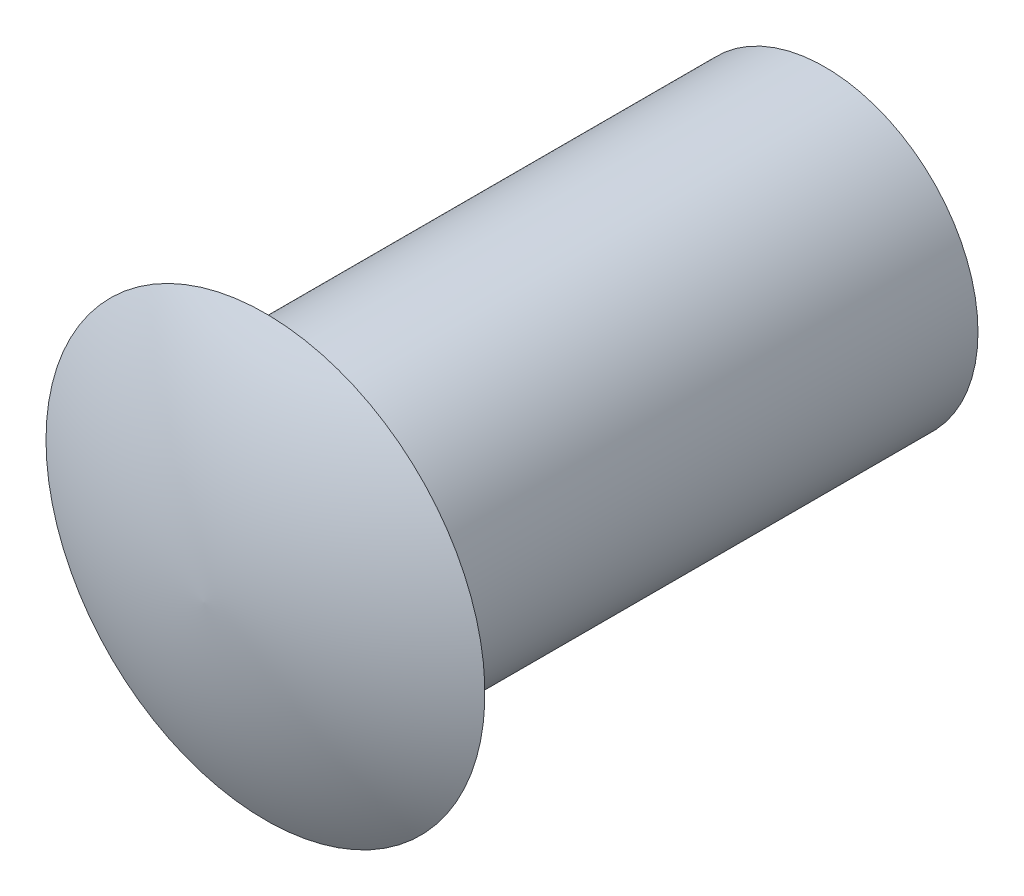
ISO-10303-21;
HEADER;
FILE_DESCRIPTION(('STEP AP214'),'2;1');
FILE_NAME('part.step','',(''),(''),'','','');
FILE_SCHEMA(('AUTOMOTIVE_DESIGN { 1 0 10303 214 1 1 1 1 }'));
ENDSEC;
DATA;
#1=APPLICATION_CONTEXT('core data for automotive mechanical design processes');
#2=APPLICATION_PROTOCOL_DEFINITION('international standard','automotive_design',2000,#1);
#3=PRODUCT_CONTEXT('',#1,'mechanical');
#4=PRODUCT('Part','Part','',(#3));
#5=PRODUCT_RELATED_PRODUCT_CATEGORY('part','',(#4));
#6=PRODUCT_DEFINITION_FORMATION('','',#4);
#7=PRODUCT_DEFINITION_CONTEXT('part definition',#1,'design');
#8=PRODUCT_DEFINITION('design','',#6,#7);
#9=PRODUCT_DEFINITION_SHAPE('','',#8);
#10=(LENGTH_UNIT() NAMED_UNIT(*) SI_UNIT(.MILLI.,.METRE.));
#11=(NAMED_UNIT(*) PLANE_ANGLE_UNIT() SI_UNIT($,.RADIAN.));
#12=(NAMED_UNIT(*) SI_UNIT($,.STERADIAN.) SOLID_ANGLE_UNIT());
#13=UNCERTAINTY_MEASURE_WITH_UNIT(LENGTH_MEASURE(1.E-05),#10,'distance_accuracy_value','');
#14=(GEOMETRIC_REPRESENTATION_CONTEXT(3) GLOBAL_UNCERTAINTY_ASSIGNED_CONTEXT((#13)) GLOBAL_UNIT_ASSIGNED_CONTEXT((#10,
#11,#12)) REPRESENTATION_CONTEXT('',''));
#15=CARTESIAN_POINT('',(0.,0.,0.));
#16=DIRECTION('',(0.,0.,1.));
#17=DIRECTION('',(1.,0.,0.));
#18=AXIS2_PLACEMENT_3D('',#15,#16,#17);
#19=CARTESIAN_POINT('',(0.,0.,-3.81));
#20=DIRECTION('',(0.,0.,1.));
#21=DIRECTION('',(1.,0.,0.));
#22=AXIS2_PLACEMENT_3D('',#19,#20,#21);
#23=CYLINDRICAL_SURFACE('',#22,1.04267733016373);
#24=CARTESIAN_POINT('',(0.,0.,-3.81));
#25=DIRECTION('',(0.,0.,1.));
#26=DIRECTION('',(1.,0.,0.));
#27=AXIS2_PLACEMENT_3D('',#24,#25,#26);
#28=CIRCLE('',#27,1.04267733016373);
#29=CARTESIAN_POINT('',(1.04267733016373,0.,-3.81));
#30=VERTEX_POINT('',#29);
#31=EDGE_CURVE('E11',#30,#30,#28,.T.);
#32=CARTESIAN_POINT('',(0.,0.,0.));
#33=DIRECTION('',(0.,0.,1.));
#34=DIRECTION('',(1.,0.,0.));
#35=AXIS2_PLACEMENT_3D('',#32,#33,#34);
#36=CIRCLE('',#35,1.04267733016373);
#37=CARTESIAN_POINT('',(1.04267733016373,0.,0.));
#38=VERTEX_POINT('',#37);
#39=EDGE_CURVE('E36',#38,#38,#36,.T.);
#40=CARTESIAN_POINT('',(1.04267733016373,0.,-3.81));
#41=CARTESIAN_POINT('',(1.04267733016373,0.,-3.7703125));
#42=CARTESIAN_POINT('',(1.04267733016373,0.,-3.730625));
#43=CARTESIAN_POINT('',(1.04267733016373,0.,-3.65125));
#44=CARTESIAN_POINT('',(1.04267733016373,0.,-3.6115625));
#45=CARTESIAN_POINT('',(1.04267733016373,0.,-3.5321875));
#46=CARTESIAN_POINT('',(1.04267733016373,0.,-3.4925));
#47=CARTESIAN_POINT('',(1.04267733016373,0.,-3.413125));
#48=CARTESIAN_POINT('',(1.04267733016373,0.,-3.3734375));
#49=CARTESIAN_POINT('',(1.04267733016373,0.,-3.2940625));
#50=CARTESIAN_POINT('',(1.04267733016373,0.,-3.254375));
#51=CARTESIAN_POINT('',(1.04267733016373,0.,-3.175));
#52=CARTESIAN_POINT('',(1.04267733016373,0.,-3.1353125));
#53=CARTESIAN_POINT('',(1.04267733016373,0.,-3.0559375));
#54=CARTESIAN_POINT('',(1.04267733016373,0.,-3.01625));
#55=CARTESIAN_POINT('',(1.04267733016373,0.,-2.936875));
#56=CARTESIAN_POINT('',(1.04267733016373,0.,-2.8971875));
#57=CARTESIAN_POINT('',(1.04267733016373,0.,-2.8178125));
#58=CARTESIAN_POINT('',(1.04267733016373,0.,-2.778125));
#59=CARTESIAN_POINT('',(1.04267733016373,0.,-2.69875));
#60=CARTESIAN_POINT('',(1.04267733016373,0.,-2.6590625));
#61=CARTESIAN_POINT('',(1.04267733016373,0.,-2.5796875));
#62=CARTESIAN_POINT('',(1.04267733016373,0.,-2.54));
#63=CARTESIAN_POINT('',(1.04267733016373,0.,-2.460625));
#64=CARTESIAN_POINT('',(1.04267733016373,0.,-2.4209375));
#65=CARTESIAN_POINT('',(1.04267733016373,0.,-2.3415625));
#66=CARTESIAN_POINT('',(1.04267733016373,0.,-2.301875));
#67=CARTESIAN_POINT('',(1.04267733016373,0.,-2.2225));
#68=CARTESIAN_POINT('',(1.04267733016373,0.,-2.1828125));
#69=CARTESIAN_POINT('',(1.04267733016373,0.,-2.1034375));
#70=CARTESIAN_POINT('',(1.04267733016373,0.,-2.06375));
#71=CARTESIAN_POINT('',(1.04267733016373,0.,-1.984375));
#72=CARTESIAN_POINT('',(1.04267733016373,0.,-1.9446875));
#73=CARTESIAN_POINT('',(1.04267733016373,0.,-1.8653125));
#74=CARTESIAN_POINT('',(1.04267733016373,0.,-1.825625));
#75=CARTESIAN_POINT('',(1.04267733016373,0.,-1.74625));
#76=CARTESIAN_POINT('',(1.04267733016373,0.,-1.7065625));
#77=CARTESIAN_POINT('',(1.04267733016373,0.,-1.6271875));
#78=CARTESIAN_POINT('',(1.04267733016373,0.,-1.5875));
#79=CARTESIAN_POINT('',(1.04267733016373,0.,-1.508125));
#80=CARTESIAN_POINT('',(1.04267733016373,0.,-1.4684375));
#81=CARTESIAN_POINT('',(1.04267733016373,0.,-1.3890625));
#82=CARTESIAN_POINT('',(1.04267733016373,0.,-1.349375));
#83=CARTESIAN_POINT('',(1.04267733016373,0.,-1.27));
#84=CARTESIAN_POINT('',(1.04267733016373,0.,-1.2303125));
#85=CARTESIAN_POINT('',(1.04267733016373,0.,-1.1509375));
#86=CARTESIAN_POINT('',(1.04267733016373,0.,-1.11125));
#87=CARTESIAN_POINT('',(1.04267733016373,0.,-1.031875));
#88=CARTESIAN_POINT('',(1.04267733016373,0.,-0.9921875));
#89=CARTESIAN_POINT('',(1.04267733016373,0.,-0.9128125));
#90=CARTESIAN_POINT('',(1.04267733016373,0.,-0.873125));
#91=CARTESIAN_POINT('',(1.04267733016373,0.,-0.79375));
#92=CARTESIAN_POINT('',(1.04267733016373,0.,-0.7540625));
#93=CARTESIAN_POINT('',(1.04267733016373,0.,-0.6746875));
#94=CARTESIAN_POINT('',(1.04267733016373,0.,-0.635));
#95=CARTESIAN_POINT('',(1.04267733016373,0.,-0.555625));
#96=CARTESIAN_POINT('',(1.04267733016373,0.,-0.5159375));
#97=CARTESIAN_POINT('',(1.04267733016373,0.,-0.4365625));
#98=CARTESIAN_POINT('',(1.04267733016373,0.,-0.396875));
#99=CARTESIAN_POINT('',(1.04267733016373,0.,-0.3175));
#100=CARTESIAN_POINT('',(1.04267733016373,0.,-0.2778125));
#101=CARTESIAN_POINT('',(1.04267733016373,0.,-0.1984375));
#102=CARTESIAN_POINT('',(1.04267733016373,0.,-0.15875));
#103=CARTESIAN_POINT('',(1.04267733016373,0.,-0.0793749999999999));
#104=CARTESIAN_POINT('',(1.04267733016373,0.,-0.0396874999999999));
#105=CARTESIAN_POINT('',(1.04267733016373,0.,0.));
#106=B_SPLINE_CURVE_WITH_KNOTS('',3,(#40,#41,#42,#43,#44,#45,#46,#47,#48,#49,#50,#51,#52,#53,
#54,#55,#56,#57,#58,#59,#60,#61,#62,#63,#64,#65,#66,#67,#68,#69,#70,#71,#72,#73,#74,#75,#76,#77,
#78,#79,#80,#81,#82,#83,#84,#85,#86,#87,#88,#89,#90,#91,#92,#93,#94,#95,#96,#97,#98,#99,#100,
#101,#102,#103,#104,#105),.UNSPECIFIED.,.F.,.F.,(4,2,2,2,2,2,2,2,2,2,2,2,2,2,2,2,2,2,2,2,2,2,2,
2,2,2,2,2,2,2,2,2,4),(0.,0.1190625,0.238125,0.3571875,0.47625,0.5953125,0.714375,0.8334375,
0.9525,1.0715625,1.190625,1.3096875,1.42875,1.5478125,1.666875,1.7859375,1.905,2.0240625,
2.143125,2.2621875,2.38125,2.5003125,2.619375,2.7384375,2.8575,2.9765625,3.095625,3.2146875,
3.33375,3.4528125,3.571875,3.6909375,3.81),.UNSPECIFIED.);
#107=EDGE_CURVE('BSEAM33',#30,#38,#106,.T.);
#108=ORIENTED_EDGE('',*,*,#31,.T.);
#109=ORIENTED_EDGE('',*,*,#39,.F.);
#110=ORIENTED_EDGE('',*,*,#107,.T.);
#111=ORIENTED_EDGE('',*,*,#107,.F.);
#112=EDGE_LOOP('',(#108,#110,#109,#111));
#113=FACE_BOUND('',#112,.T.);
#114=ADVANCED_FACE('F33',(#113),#23,.T.);
#115=CARTESIAN_POINT('',(0.,0.,-3.81));
#116=DIRECTION('',(0.,0.,1.));
#117=DIRECTION('',(1.,0.,0.));
#118=AXIS2_PLACEMENT_3D('',#115,#116,#117);
#119=PLANE('',#118);
#120=ORIENTED_EDGE('',*,*,#31,.F.);
#121=EDGE_LOOP('',(#120));
#122=FACE_BOUND('',#121,.T.);
#123=ADVANCED_FACE('F50',(#122),#119,.F.);
#124=CARTESIAN_POINT('',(0.,0.,0.));
#125=DIRECTION('',(0.,0.,1.));
#126=DIRECTION('',(1.,0.,0.));
#127=AXIS2_PLACEMENT_3D('',#124,#125,#126);
#128=PLANE('',#127);
#129=ORIENTED_EDGE('',*,*,#39,.T.);
#130=EDGE_LOOP('',(#129));
#131=FACE_BOUND('',#130,.T.);
#132=CARTESIAN_POINT('',(0.,0.,0.));
#133=DIRECTION('',(0.,0.,-1.));
#134=DIRECTION('',(-1.,0.,0.));
#135=AXIS2_PLACEMENT_3D('',#132,#133,#134);
#136=CIRCLE('',#135,1.49446619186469);
#137=CARTESIAN_POINT('',(-1.49446619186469,0.,0.));
#138=VERTEX_POINT('',#137);
#139=EDGE_CURVE('E64',#138,#138,#136,.T.);
#140=ORIENTED_EDGE('',*,*,#139,.T.);
#141=EDGE_LOOP('',(#140));
#142=FACE_BOUND('',#141,.T.);
#143=ADVANCED_FACE('F44',(#131,#142),#128,.F.);
#144=CARTESIAN_POINT('',(0.105270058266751,0.,-2.83099406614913));
#145=DIRECTION('',(0.,-1.,0.));
#146=DIRECTION('',(-1.,0.,0.));
#147=AXIS2_PLACEMENT_3D('',#144,#145,#146);
#148=CIRCLE('',#147,3.25172007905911);
#149=TRIMMED_CURVE('',#148,(PARAMETER_VALUE(-1.53841701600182)),
(PARAMETER_VALUE(1.53841701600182)),.T.,.PARAMETER.);
#150=CARTESIAN_POINT('',(0.,0.,-2.83099406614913));
#151=DIRECTION('',(0.,0.,-1.));
#152=AXIS1_PLACEMENT('',#150,#151);
#153=SURFACE_OF_REVOLUTION('',#149,#152);
#154=ORIENTED_EDGE('',*,*,#139,.F.);
#155=EDGE_LOOP('',(#154));
#156=FACE_BOUND('',#155,.T.);
#157=CARTESIAN_POINT('',(0.,0.,0.419021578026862));
#158=VERTEX_POINT('',#157);
#159=VERTEX_LOOP('',#158);
#160=FACE_BOUND('',#159,.T.);
#161=ADVANCED_FACE('F42',(#156,#160),#153,.T.);
#162=CLOSED_SHELL('',(#114,#123,#143,#161));
#163=MANIFOLD_SOLID_BREP('B2',#162);
#164=ADVANCED_BREP_SHAPE_REPRESENTATION('',(#18,#163),#14);
#165=SHAPE_DEFINITION_REPRESENTATION(#9,#164);
ENDSEC;
END-ISO-10303-21;
